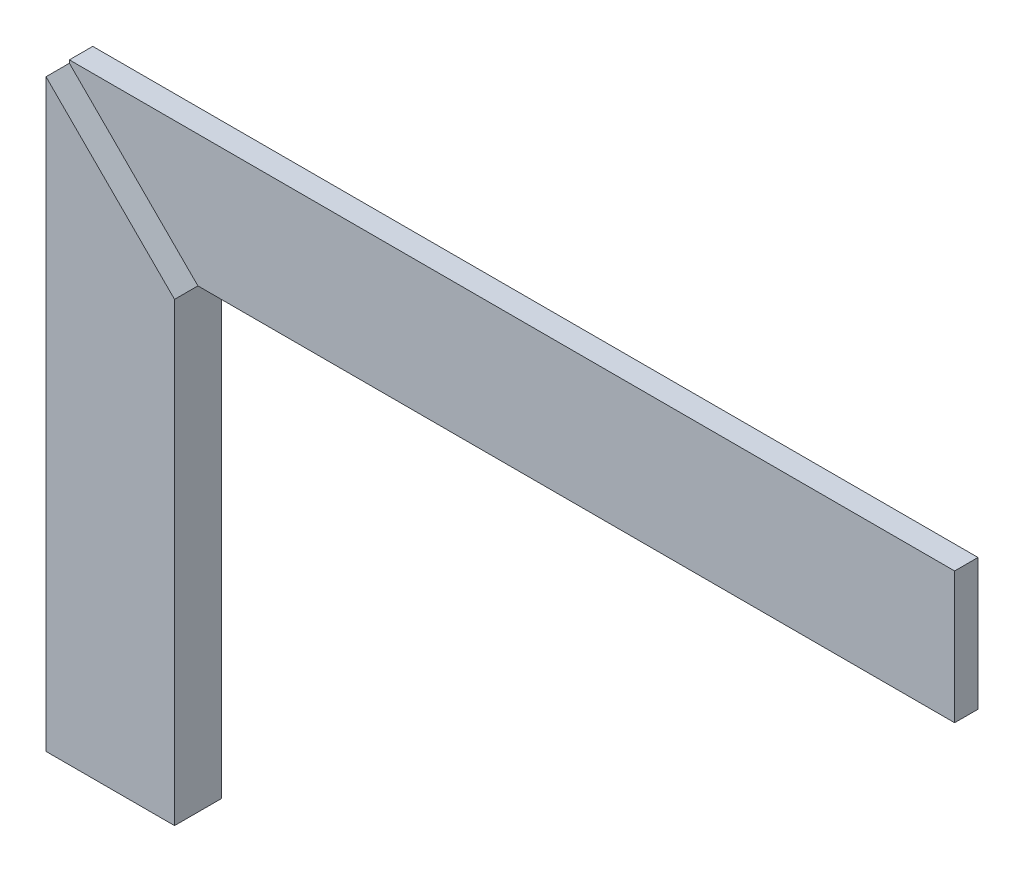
ISO-10303-21;
HEADER;
FILE_DESCRIPTION(('STEP AP214'),'2;1');
FILE_NAME('part.step','',(''),(''),'','','');
FILE_SCHEMA(('AUTOMOTIVE_DESIGN { 1 0 10303 214 1 1 1 1 }'));
ENDSEC;
DATA;
#1=APPLICATION_CONTEXT('core data for automotive mechanical design processes');
#2=APPLICATION_PROTOCOL_DEFINITION('international standard','automotive_design',2000,#1);
#3=PRODUCT_CONTEXT('',#1,'mechanical');
#4=PRODUCT('Part','Part','',(#3));
#5=PRODUCT_RELATED_PRODUCT_CATEGORY('part','',(#4));
#6=PRODUCT_DEFINITION_FORMATION('','',#4);
#7=PRODUCT_DEFINITION_CONTEXT('part definition',#1,'design');
#8=PRODUCT_DEFINITION('design','',#6,#7);
#9=PRODUCT_DEFINITION_SHAPE('','',#8);
#10=(LENGTH_UNIT() NAMED_UNIT(*) SI_UNIT(.MILLI.,.METRE.));
#11=(NAMED_UNIT(*) PLANE_ANGLE_UNIT() SI_UNIT($,.RADIAN.));
#12=(NAMED_UNIT(*) SI_UNIT($,.STERADIAN.) SOLID_ANGLE_UNIT());
#13=UNCERTAINTY_MEASURE_WITH_UNIT(LENGTH_MEASURE(1.E-05),#10,'distance_accuracy_value','');
#14=(GEOMETRIC_REPRESENTATION_CONTEXT(3) GLOBAL_UNCERTAINTY_ASSIGNED_CONTEXT((#13)) GLOBAL_UNIT_ASSIGNED_CONTEXT((#10,
#11,#12)) REPRESENTATION_CONTEXT('',''));
#15=CARTESIAN_POINT('',(0.,0.,0.));
#16=DIRECTION('',(0.,0.,1.));
#17=DIRECTION('',(1.,0.,0.));
#18=AXIS2_PLACEMENT_3D('',#15,#16,#17);
#19=CARTESIAN_POINT('',(0.,-201.,16.));
#20=DIRECTION('',(1.,0.,0.));
#21=DIRECTION('',(0.,1.,0.));
#22=AXIS2_PLACEMENT_3D('',#19,#20,#21);
#23=PLANE('',#22);
#24=DIRECTION('',(0.,-1.,0.));
#25=VECTOR('',#24,1.);
#26=CARTESIAN_POINT('',(0.,-201.,16.));
#27=LINE('',#26,#25);
#28=CARTESIAN_POINT('',(0.,-1.00000000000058,16.));
#29=VERTEX_POINT('',#28);
#30=CARTESIAN_POINT('',(0.,-201.,16.));
#31=VERTEX_POINT('',#30);
#32=EDGE_CURVE('E112',#29,#31,#27,.T.);
#33=ORIENTED_EDGE('',*,*,#32,.F.);
#34=DIRECTION('',(0.,0.,1.));
#35=VECTOR('',#34,1.);
#36=CARTESIAN_POINT('',(0.,-1.00000000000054,8.));
#37=LINE('',#36,#35);
#38=CARTESIAN_POINT('',(0.,-1.00000000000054,8.));
#39=VERTEX_POINT('',#38);
#40=EDGE_CURVE('E54',#39,#29,#37,.T.);
#41=ORIENTED_EDGE('',*,*,#40,.F.);
#42=DIRECTION('',(0.,-1.,0.));
#43=VECTOR('',#42,1.);
#44=CARTESIAN_POINT('',(0.,-1.00000000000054,8.));
#45=LINE('',#44,#43);
#46=CARTESIAN_POINT('',(0.,0.,8.));
#47=VERTEX_POINT('',#46);
#48=EDGE_CURVE('E97',#47,#39,#45,.T.);
#49=ORIENTED_EDGE('',*,*,#48,.F.);
#50=DIRECTION('',(0.,0.,-1.));
#51=VECTOR('',#50,1.);
#52=CARTESIAN_POINT('',(0.,0.,16.));
#53=LINE('',#52,#51);
#54=CARTESIAN_POINT('',(0.,0.,0.));
#55=VERTEX_POINT('',#54);
#56=EDGE_CURVE('E89',#47,#55,#53,.T.);
#57=ORIENTED_EDGE('',*,*,#56,.T.);
#58=DIRECTION('',(0.,-1.,0.));
#59=VECTOR('',#58,1.);
#60=CARTESIAN_POINT('',(0.,-201.,0.));
#61=LINE('',#60,#59);
#62=CARTESIAN_POINT('',(0.,-201.,0.));
#63=VERTEX_POINT('',#62);
#64=EDGE_CURVE('E94',#55,#63,#61,.T.);
#65=ORIENTED_EDGE('',*,*,#64,.T.);
#66=DIRECTION('',(0.,0.,-1.));
#67=VECTOR('',#66,1.);
#68=CARTESIAN_POINT('',(0.,-201.,16.));
#69=LINE('',#68,#67);
#70=EDGE_CURVE('E11',#31,#63,#69,.T.);
#71=ORIENTED_EDGE('',*,*,#70,.F.);
#72=EDGE_LOOP('',(#33,#41,#49,#57,#65,#71));
#73=FACE_BOUND('',#72,.T.);
#74=ADVANCED_FACE('F39',(#73),#23,.F.);
#75=CARTESIAN_POINT('',(44.,-201.,16.));
#76=DIRECTION('',(0.,1.,0.));
#77=DIRECTION('',(0.,0.,1.));
#78=AXIS2_PLACEMENT_3D('',#75,#76,#77);
#79=PLANE('',#78);
#80=DIRECTION('',(1.,0.,0.));
#81=VECTOR('',#80,1.);
#82=CARTESIAN_POINT('',(44.,-201.,0.));
#83=LINE('',#82,#81);
#84=CARTESIAN_POINT('',(44.,-201.,0.));
#85=VERTEX_POINT('',#84);
#86=EDGE_CURVE('E117',#63,#85,#83,.T.);
#87=ORIENTED_EDGE('',*,*,#86,.T.);
#88=DIRECTION('',(0.,0.,-1.));
#89=VECTOR('',#88,1.);
#90=CARTESIAN_POINT('',(44.,-201.,16.));
#91=LINE('',#90,#89);
#92=CARTESIAN_POINT('',(44.,-201.,16.));
#93=VERTEX_POINT('',#92);
#94=EDGE_CURVE('E47',#93,#85,#91,.T.);
#95=ORIENTED_EDGE('',*,*,#94,.F.);
#96=DIRECTION('',(1.,0.,0.));
#97=VECTOR('',#96,1.);
#98=CARTESIAN_POINT('',(44.,-201.,16.));
#99=LINE('',#98,#97);
#100=EDGE_CURVE('E63',#31,#93,#99,.T.);
#101=ORIENTED_EDGE('',*,*,#100,.F.);
#102=ORIENTED_EDGE('',*,*,#70,.T.);
#103=EDGE_LOOP('',(#87,#95,#101,#102));
#104=FACE_BOUND('',#103,.T.);
#105=ADVANCED_FACE('F211',(#104),#79,.F.);
#106=CARTESIAN_POINT('',(44.,-45.,16.));
#107=DIRECTION('',(-1.,0.,0.));
#108=DIRECTION('',(0.,-1.,0.));
#109=AXIS2_PLACEMENT_3D('',#106,#107,#108);
#110=PLANE('',#109);
#111=DIRECTION('',(0.,1.,0.));
#112=VECTOR('',#111,1.);
#113=CARTESIAN_POINT('',(44.,-45.,0.));
#114=LINE('',#113,#112);
#115=CARTESIAN_POINT('',(44.,-45.,0.));
#116=VERTEX_POINT('',#115);
#117=EDGE_CURVE('E122',#85,#116,#114,.T.);
#118=ORIENTED_EDGE('',*,*,#117,.T.);
#119=DIRECTION('',(0.,0.,-1.));
#120=VECTOR('',#119,1.);
#121=CARTESIAN_POINT('',(44.,-45.,16.));
#122=LINE('',#121,#120);
#123=CARTESIAN_POINT('',(44.,-45.,8.));
#124=VERTEX_POINT('',#123);
#125=EDGE_CURVE('E143',#124,#116,#122,.T.);
#126=ORIENTED_EDGE('',*,*,#125,.F.);
#127=CARTESIAN_POINT('',(44.,-45.,16.));
#128=VERTEX_POINT('',#127);
#129=EDGE_CURVE('E144',#128,#124,#122,.T.);
#130=ORIENTED_EDGE('',*,*,#129,.F.);
#131=DIRECTION('',(0.,1.,0.));
#132=VECTOR('',#131,1.);
#133=CARTESIAN_POINT('',(44.,-45.,16.));
#134=LINE('',#133,#132);
#135=EDGE_CURVE('E102',#93,#128,#134,.T.);
#136=ORIENTED_EDGE('',*,*,#135,.F.);
#137=ORIENTED_EDGE('',*,*,#94,.T.);
#138=EDGE_LOOP('',(#118,#126,#130,#136,#137));
#139=FACE_BOUND('',#138,.T.);
#140=ADVANCED_FACE('F151',(#139),#110,.F.);
#141=CARTESIAN_POINT('',(303.,-45.,16.));
#142=DIRECTION('',(0.,1.,0.));
#143=DIRECTION('',(-1.,0.,0.));
#144=AXIS2_PLACEMENT_3D('',#141,#142,#143);
#145=PLANE('',#144);
#146=DIRECTION('',(0.,0.,-1.));
#147=VECTOR('',#146,1.);
#148=CARTESIAN_POINT('',(303.,-45.,16.));
#149=LINE('',#148,#147);
#150=CARTESIAN_POINT('',(303.,-45.,8.));
#151=VERTEX_POINT('',#150);
#152=CARTESIAN_POINT('',(303.,-45.,0.));
#153=VERTEX_POINT('',#152);
#154=EDGE_CURVE('E140',#151,#153,#149,.T.);
#155=ORIENTED_EDGE('',*,*,#154,.F.);
#156=DIRECTION('',(1.,0.,0.));
#157=VECTOR('',#156,1.);
#158=CARTESIAN_POINT('',(303.,-45.,8.));
#159=LINE('',#158,#157);
#160=EDGE_CURVE('E162',#124,#151,#159,.T.);
#161=ORIENTED_EDGE('',*,*,#160,.F.);
#162=ORIENTED_EDGE('',*,*,#125,.T.);
#163=DIRECTION('',(1.,0.,0.));
#164=VECTOR('',#163,1.);
#165=CARTESIAN_POINT('',(303.,-45.,0.));
#166=LINE('',#165,#164);
#167=EDGE_CURVE('E132',#116,#153,#166,.T.);
#168=ORIENTED_EDGE('',*,*,#167,.T.);
#169=EDGE_LOOP('',(#155,#161,#162,#168));
#170=FACE_BOUND('',#169,.T.);
#171=ADVANCED_FACE('F158',(#170),#145,.F.);
#172=CARTESIAN_POINT('',(303.,0.,16.));
#173=DIRECTION('',(-1.,0.,0.));
#174=DIRECTION('',(0.,0.,1.));
#175=AXIS2_PLACEMENT_3D('',#172,#173,#174);
#176=PLANE('',#175);
#177=DIRECTION('',(0.,0.,-1.));
#178=VECTOR('',#177,1.);
#179=CARTESIAN_POINT('',(303.,0.,16.));
#180=LINE('',#179,#178);
#181=CARTESIAN_POINT('',(303.,0.,8.));
#182=VERTEX_POINT('',#181);
#183=CARTESIAN_POINT('',(303.,0.,0.));
#184=VERTEX_POINT('',#183);
#185=EDGE_CURVE('E101',#182,#184,#180,.T.);
#186=ORIENTED_EDGE('',*,*,#185,.F.);
#187=DIRECTION('',(0.,1.,0.));
#188=VECTOR('',#187,1.);
#189=CARTESIAN_POINT('',(303.,0.,8.));
#190=LINE('',#189,#188);
#191=EDGE_CURVE('E181',#151,#182,#190,.T.);
#192=ORIENTED_EDGE('',*,*,#191,.F.);
#193=ORIENTED_EDGE('',*,*,#154,.T.);
#194=DIRECTION('',(0.,1.,0.));
#195=VECTOR('',#194,1.);
#196=CARTESIAN_POINT('',(303.,0.,0.));
#197=LINE('',#196,#195);
#198=EDGE_CURVE('E113',#153,#184,#197,.T.);
#199=ORIENTED_EDGE('',*,*,#198,.T.);
#200=EDGE_LOOP('',(#186,#192,#193,#199));
#201=FACE_BOUND('',#200,.T.);
#202=ADVANCED_FACE('F193',(#201),#176,.F.);
#203=CARTESIAN_POINT('',(0.,0.,16.));
#204=DIRECTION('',(0.,-1.,0.));
#205=DIRECTION('',(0.,0.,-1.));
#206=AXIS2_PLACEMENT_3D('',#203,#204,#205);
#207=PLANE('',#206);
#208=ORIENTED_EDGE('',*,*,#56,.F.);
#209=DIRECTION('',(-1.,0.,0.));
#210=VECTOR('',#209,1.);
#211=CARTESIAN_POINT('',(0.,0.,8.));
#212=LINE('',#211,#210);
#213=EDGE_CURVE('E177',#182,#47,#212,.T.);
#214=ORIENTED_EDGE('',*,*,#213,.F.);
#215=ORIENTED_EDGE('',*,*,#185,.T.);
#216=DIRECTION('',(-1.,0.,0.));
#217=VECTOR('',#216,1.);
#218=CARTESIAN_POINT('',(0.,0.,0.));
#219=LINE('',#218,#217);
#220=EDGE_CURVE('E105',#184,#55,#219,.T.);
#221=ORIENTED_EDGE('',*,*,#220,.T.);
#222=EDGE_LOOP('',(#208,#214,#215,#221));
#223=FACE_BOUND('',#222,.T.);
#224=ADVANCED_FACE('F106',(#223),#207,.F.);
#225=CARTESIAN_POINT('',(0.,0.,16.));
#226=DIRECTION('',(0.,0.,-1.));
#227=DIRECTION('',(-1.,0.,0.));
#228=AXIS2_PLACEMENT_3D('',#225,#226,#227);
#229=PLANE('',#228);
#230=ORIENTED_EDGE('',*,*,#135,.T.);
#231=DIRECTION('',(0.707106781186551,-0.707106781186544,0.));
#232=VECTOR('',#231,1.);
#233=CARTESIAN_POINT('',(44.,-45.,16.));
#234=LINE('',#233,#232);
#235=EDGE_CURVE('E169',#29,#128,#234,.T.);
#236=ORIENTED_EDGE('',*,*,#235,.F.);
#237=ORIENTED_EDGE('',*,*,#32,.T.);
#238=ORIENTED_EDGE('',*,*,#100,.T.);
#239=EDGE_LOOP('',(#230,#236,#237,#238));
#240=FACE_BOUND('',#239,.T.);
#241=ADVANCED_FACE('F200',(#240),#229,.F.);
#242=CARTESIAN_POINT('',(0.,0.,0.));
#243=DIRECTION('',(0.,0.,-1.));
#244=DIRECTION('',(-1.,0.,0.));
#245=AXIS2_PLACEMENT_3D('',#242,#243,#244);
#246=PLANE('',#245);
#247=ORIENTED_EDGE('',*,*,#64,.F.);
#248=ORIENTED_EDGE('',*,*,#220,.F.);
#249=ORIENTED_EDGE('',*,*,#198,.F.);
#250=ORIENTED_EDGE('',*,*,#167,.F.);
#251=ORIENTED_EDGE('',*,*,#117,.F.);
#252=ORIENTED_EDGE('',*,*,#86,.F.);
#253=EDGE_LOOP('',(#247,#248,#249,#250,#251,#252));
#254=FACE_BOUND('',#253,.T.);
#255=ADVANCED_FACE('F115',(#254),#246,.T.);
#256=CARTESIAN_POINT('',(44.,-45.,8.));
#257=DIRECTION('',(-0.707106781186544,-0.707106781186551,0.));
#258=DIRECTION('',(0.707106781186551,-0.707106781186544,0.));
#259=AXIS2_PLACEMENT_3D('',#256,#257,#258);
#260=PLANE('',#259);
#261=ORIENTED_EDGE('',*,*,#235,.T.);
#262=ORIENTED_EDGE('',*,*,#129,.T.);
#263=DIRECTION('',(0.707106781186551,-0.707106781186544,0.));
#264=VECTOR('',#263,1.);
#265=CARTESIAN_POINT('',(44.,-45.,8.));
#266=LINE('',#265,#264);
#267=EDGE_CURVE('E124',#39,#124,#266,.T.);
#268=ORIENTED_EDGE('',*,*,#267,.F.);
#269=ORIENTED_EDGE('',*,*,#40,.T.);
#270=EDGE_LOOP('',(#261,#262,#268,#269));
#271=FACE_BOUND('',#270,.T.);
#272=ADVANCED_FACE('F199',(#271),#260,.F.);
#273=CARTESIAN_POINT('',(0.,0.,8.));
#274=DIRECTION('',(0.,0.,-1.));
#275=DIRECTION('',(-1.,0.,0.));
#276=AXIS2_PLACEMENT_3D('',#273,#274,#275);
#277=PLANE('',#276);
#278=ORIENTED_EDGE('',*,*,#160,.T.);
#279=ORIENTED_EDGE('',*,*,#191,.T.);
#280=ORIENTED_EDGE('',*,*,#213,.T.);
#281=ORIENTED_EDGE('',*,*,#48,.T.);
#282=ORIENTED_EDGE('',*,*,#267,.T.);
#283=EDGE_LOOP('',(#278,#279,#280,#281,#282));
#284=FACE_BOUND('',#283,.T.);
#285=ADVANCED_FACE('F188',(#284),#277,.F.);
#286=CLOSED_SHELL('',(#74,#105,#140,#171,#202,#224,#241,#255,#272,#285));
#287=MANIFOLD_SOLID_BREP('B2',#286);
#288=ADVANCED_BREP_SHAPE_REPRESENTATION('',(#18,#287),#14);
#289=SHAPE_DEFINITION_REPRESENTATION(#9,#288);
ENDSEC;
END-ISO-10303-21;
